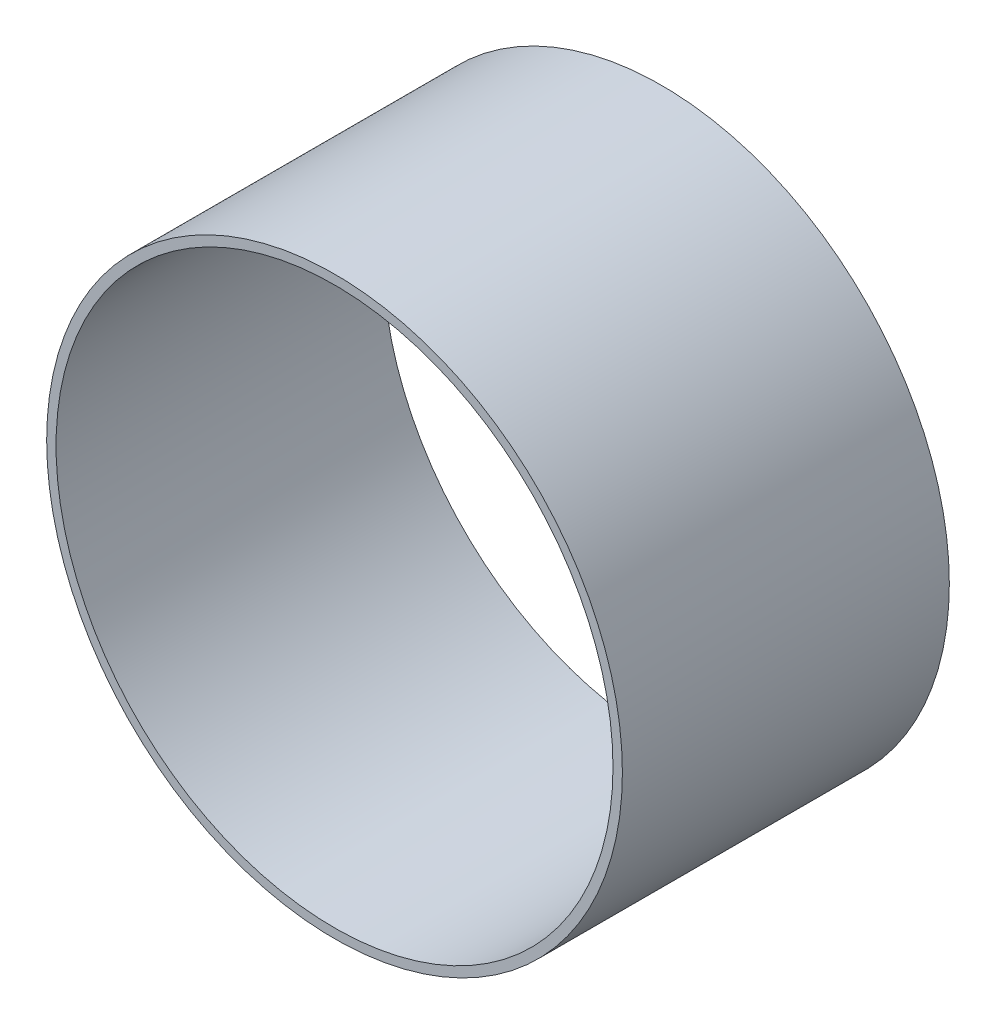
ISO-10303-21;
HEADER;
FILE_DESCRIPTION(('STEP AP214'),'2;1');
FILE_NAME('part.step','',(''),(''),'','','');
FILE_SCHEMA(('AUTOMOTIVE_DESIGN { 1 0 10303 214 1 1 1 1 }'));
ENDSEC;
DATA;
#1=APPLICATION_CONTEXT('core data for automotive mechanical design processes');
#2=APPLICATION_PROTOCOL_DEFINITION('international standard','automotive_design',2000,#1);
#3=PRODUCT_CONTEXT('',#1,'mechanical');
#4=PRODUCT('Part','Part','',(#3));
#5=PRODUCT_RELATED_PRODUCT_CATEGORY('part','',(#4));
#6=PRODUCT_DEFINITION_FORMATION('','',#4);
#7=PRODUCT_DEFINITION_CONTEXT('part definition',#1,'design');
#8=PRODUCT_DEFINITION('design','',#6,#7);
#9=PRODUCT_DEFINITION_SHAPE('','',#8);
#10=(LENGTH_UNIT() NAMED_UNIT(*) SI_UNIT(.MILLI.,.METRE.));
#11=(NAMED_UNIT(*) PLANE_ANGLE_UNIT() SI_UNIT($,.RADIAN.));
#12=(NAMED_UNIT(*) SI_UNIT($,.STERADIAN.) SOLID_ANGLE_UNIT());
#13=UNCERTAINTY_MEASURE_WITH_UNIT(LENGTH_MEASURE(1.E-05),#10,'distance_accuracy_value','');
#14=(GEOMETRIC_REPRESENTATION_CONTEXT(3) GLOBAL_UNCERTAINTY_ASSIGNED_CONTEXT((#13)) GLOBAL_UNIT_ASSIGNED_CONTEXT((#10,
#11,#12)) REPRESENTATION_CONTEXT('',''));
#15=CARTESIAN_POINT('',(0.,0.,0.));
#16=DIRECTION('',(0.,0.,1.));
#17=DIRECTION('',(1.,0.,0.));
#18=AXIS2_PLACEMENT_3D('',#15,#16,#17);
#19=CARTESIAN_POINT('',(0.,0.,13.25));
#20=DIRECTION('',(0.,0.,1.));
#21=DIRECTION('',(1.,0.,0.));
#22=AXIS2_PLACEMENT_3D('',#19,#20,#21);
#23=PLANE('',#22);
#24=CARTESIAN_POINT('',(0.,0.,13.25));
#25=DIRECTION('',(0.,0.,1.));
#26=DIRECTION('',(1.,0.,0.));
#27=AXIS2_PLACEMENT_3D('',#24,#25,#26);
#28=CIRCLE('',#27,23.33244);
#29=CARTESIAN_POINT('',(23.33244,0.,13.25));
#30=VERTEX_POINT('',#29);
#31=EDGE_CURVE('E11',#30,#30,#28,.T.);
#32=ORIENTED_EDGE('',*,*,#31,.T.);
#33=EDGE_LOOP('',(#32));
#34=FACE_BOUND('',#33,.T.);
#35=CARTESIAN_POINT('',(0.,0.,13.25));
#36=DIRECTION('',(0.,0.,1.));
#37=DIRECTION('',(1.,0.,0.));
#38=AXIS2_PLACEMENT_3D('',#35,#36,#37);
#39=CIRCLE('',#38,22.57044);
#40=CARTESIAN_POINT('',(22.57044,0.,13.25));
#41=VERTEX_POINT('',#40);
#42=EDGE_CURVE('E47',#41,#41,#39,.T.);
#43=ORIENTED_EDGE('',*,*,#42,.F.);
#44=EDGE_LOOP('',(#43));
#45=FACE_BOUND('',#44,.T.);
#46=ADVANCED_FACE('F36',(#34,#45),#23,.T.);
#47=CARTESIAN_POINT('',(0.,0.,-13.25));
#48=DIRECTION('',(0.,0.,1.));
#49=DIRECTION('',(1.,0.,0.));
#50=AXIS2_PLACEMENT_3D('',#47,#48,#49);
#51=PLANE('',#50);
#52=CARTESIAN_POINT('',(0.,0.,-13.25));
#53=DIRECTION('',(0.,0.,1.));
#54=DIRECTION('',(1.,0.,0.));
#55=AXIS2_PLACEMENT_3D('',#52,#53,#54);
#56=CIRCLE('',#55,23.33244);
#57=CARTESIAN_POINT('',(23.33244,0.,-13.25));
#58=VERTEX_POINT('',#57);
#59=EDGE_CURVE('E40',#58,#58,#56,.T.);
#60=ORIENTED_EDGE('',*,*,#59,.F.);
#61=EDGE_LOOP('',(#60));
#62=FACE_BOUND('',#61,.T.);
#63=CARTESIAN_POINT('',(0.,0.,-13.25));
#64=DIRECTION('',(0.,0.,1.));
#65=DIRECTION('',(1.,0.,0.));
#66=AXIS2_PLACEMENT_3D('',#63,#64,#65);
#67=CIRCLE('',#66,22.57044);
#68=CARTESIAN_POINT('',(22.57044,0.,-13.25));
#69=VERTEX_POINT('',#68);
#70=EDGE_CURVE('E49',#69,#69,#67,.T.);
#71=ORIENTED_EDGE('',*,*,#70,.T.);
#72=EDGE_LOOP('',(#71));
#73=FACE_BOUND('',#72,.T.);
#74=ADVANCED_FACE('F59',(#62,#73),#51,.F.);
#75=CARTESIAN_POINT('',(0.,0.,13.25));
#76=DIRECTION('',(0.,0.,-1.));
#77=DIRECTION('',(-1.,0.,0.));
#78=AXIS2_PLACEMENT_3D('',#75,#76,#77);
#79=CYLINDRICAL_SURFACE('',#78,23.33244);
#80=ORIENTED_EDGE('',*,*,#31,.F.);
#81=EDGE_LOOP('',(#80));
#82=FACE_BOUND('',#81,.T.);
#83=ORIENTED_EDGE('',*,*,#59,.T.);
#84=EDGE_LOOP('',(#83));
#85=FACE_BOUND('',#84,.T.);
#86=ADVANCED_FACE('F38',(#82,#85),#79,.T.);
#87=CARTESIAN_POINT('',(0.,0.,13.25));
#88=DIRECTION('',(0.,0.,-1.));
#89=DIRECTION('',(-1.,0.,0.));
#90=AXIS2_PLACEMENT_3D('',#87,#88,#89);
#91=CYLINDRICAL_SURFACE('',#90,22.57044);
#92=ORIENTED_EDGE('',*,*,#42,.T.);
#93=EDGE_LOOP('',(#92));
#94=FACE_BOUND('',#93,.T.);
#95=ORIENTED_EDGE('',*,*,#70,.F.);
#96=EDGE_LOOP('',(#95));
#97=FACE_BOUND('',#96,.T.);
#98=ADVANCED_FACE('F55',(#94,#97),#91,.F.);
#99=CLOSED_SHELL('',(#46,#74,#86,#98));
#100=MANIFOLD_SOLID_BREP('B2',#99);
#101=ADVANCED_BREP_SHAPE_REPRESENTATION('',(#18,#100),#14);
#102=SHAPE_DEFINITION_REPRESENTATION(#9,#101);
ENDSEC;
END-ISO-10303-21;
